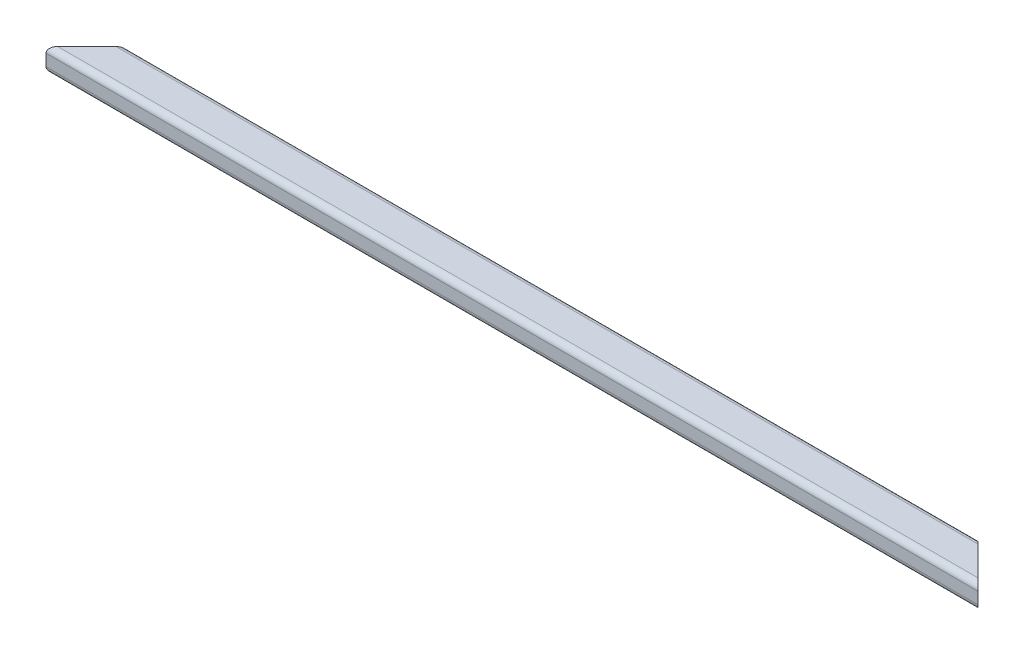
ISO-10303-21;
HEADER;
FILE_DESCRIPTION(('STEP AP214'),'2;1');
FILE_NAME('part.step','',(''),(''),'','','');
FILE_SCHEMA(('AUTOMOTIVE_DESIGN { 1 0 10303 214 1 1 1 1 }'));
ENDSEC;
DATA;
#1=APPLICATION_CONTEXT('core data for automotive mechanical design processes');
#2=APPLICATION_PROTOCOL_DEFINITION('international standard','automotive_design',2000,#1);
#3=PRODUCT_CONTEXT('',#1,'mechanical');
#4=PRODUCT('Part','Part','',(#3));
#5=PRODUCT_RELATED_PRODUCT_CATEGORY('part','',(#4));
#6=PRODUCT_DEFINITION_FORMATION('','',#4);
#7=PRODUCT_DEFINITION_CONTEXT('part definition',#1,'design');
#8=PRODUCT_DEFINITION('design','',#6,#7);
#9=PRODUCT_DEFINITION_SHAPE('','',#8);
#10=(LENGTH_UNIT() NAMED_UNIT(*) SI_UNIT(.MILLI.,.METRE.));
#11=(NAMED_UNIT(*) PLANE_ANGLE_UNIT() SI_UNIT($,.RADIAN.));
#12=(NAMED_UNIT(*) SI_UNIT($,.STERADIAN.) SOLID_ANGLE_UNIT());
#13=UNCERTAINTY_MEASURE_WITH_UNIT(LENGTH_MEASURE(1.E-05),#10,'distance_accuracy_value','');
#14=(GEOMETRIC_REPRESENTATION_CONTEXT(3) GLOBAL_UNCERTAINTY_ASSIGNED_CONTEXT((#13)) GLOBAL_UNIT_ASSIGNED_CONTEXT((#10,
#11,#12)) REPRESENTATION_CONTEXT('',''));
#15=CARTESIAN_POINT('',(0.,0.,0.));
#16=DIRECTION('',(0.,0.,1.));
#17=DIRECTION('',(1.,0.,0.));
#18=AXIS2_PLACEMENT_3D('',#15,#16,#17);
#19=CARTESIAN_POINT('',(800.,5.,-12.5));
#20=DIRECTION('',(-1.,0.,0.));
#21=DIRECTION('',(0.,0.,1.));
#22=AXIS2_PLACEMENT_3D('',#19,#20,#21);
#23=CYLINDRICAL_SURFACE('',#22,5.);
#24=DIRECTION('',(-1.,0.,0.));
#25=VECTOR('',#24,1.);
#26=CARTESIAN_POINT('',(800.,5.,-17.5));
#27=LINE('',#26,#25);
#28=CARTESIAN_POINT('',(765.,5.,-17.5));
#29=VERTEX_POINT('',#28);
#30=CARTESIAN_POINT('',(34.9999999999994,5.,-17.5));
#31=VERTEX_POINT('',#30);
#32=EDGE_CURVE('E222',#29,#31,#27,.T.);
#33=ORIENTED_EDGE('',*,*,#32,.T.);
#34=CARTESIAN_POINT('',(29.9999999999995,5.,-12.5));
#35=DIRECTION('',(0.707106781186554,0.,0.707106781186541));
#36=DIRECTION('',(-0.707106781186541,0.,0.707106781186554));
#37=AXIS2_PLACEMENT_3D('',#34,#35,#36);
#38=ELLIPSE('',#37,7.07106781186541,5.);
#39=CARTESIAN_POINT('',(29.9999999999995,10.,-12.5));
#40=VERTEX_POINT('',#39);
#41=EDGE_CURVE('E47',#31,#40,#38,.T.);
#42=ORIENTED_EDGE('',*,*,#41,.T.);
#43=DIRECTION('',(-1.,0.,0.));
#44=VECTOR('',#43,1.);
#45=CARTESIAN_POINT('',(800.,10.,-12.5));
#46=LINE('',#45,#44);
#47=CARTESIAN_POINT('',(770.,10.,-12.5));
#48=VERTEX_POINT('',#47);
#49=EDGE_CURVE('E161',#48,#40,#46,.T.);
#50=ORIENTED_EDGE('',*,*,#49,.F.);
#51=CARTESIAN_POINT('',(770.,5.,-12.5));
#52=DIRECTION('',(-0.707106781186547,0.,0.707106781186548));
#53=DIRECTION('',(-0.707106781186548,0.,-0.707106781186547));
#54=AXIS2_PLACEMENT_3D('',#51,#52,#53);
#55=ELLIPSE('',#54,7.07106781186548,5.);
#56=EDGE_CURVE('E201',#48,#29,#55,.T.);
#57=ORIENTED_EDGE('',*,*,#56,.T.);
#58=EDGE_LOOP('',(#33,#42,#50,#57));
#59=FACE_BOUND('',#58,.T.);
#60=ADVANCED_FACE('F33',(#59),#23,.T.);
#61=CARTESIAN_POINT('',(800.,10.,12.5));
#62=DIRECTION('',(0.,-1.,0.));
#63=DIRECTION('',(0.,0.,-1.));
#64=AXIS2_PLACEMENT_3D('',#61,#62,#63);
#65=PLANE('',#64);
#66=ORIENTED_EDGE('',*,*,#49,.T.);
#67=DIRECTION('',(0.707106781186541,0.,-0.707106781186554));
#68=VECTOR('',#67,1.);
#69=CARTESIAN_POINT('',(0.,10.,17.5));
#70=LINE('',#69,#68);
#71=CARTESIAN_POINT('',(4.9999999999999,10.,12.5));
#72=VERTEX_POINT('',#71);
#73=EDGE_CURVE('E145',#72,#40,#70,.T.);
#74=ORIENTED_EDGE('',*,*,#73,.F.);
#75=DIRECTION('',(-1.,0.,0.));
#76=VECTOR('',#75,1.);
#77=CARTESIAN_POINT('',(800.,10.,12.5));
#78=LINE('',#77,#76);
#79=CARTESIAN_POINT('',(795.,10.,12.5));
#80=VERTEX_POINT('',#79);
#81=EDGE_CURVE('E159',#80,#72,#78,.T.);
#82=ORIENTED_EDGE('',*,*,#81,.F.);
#83=DIRECTION('',(0.707106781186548,0.,0.707106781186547));
#84=VECTOR('',#83,1.);
#85=CARTESIAN_POINT('',(800.,10.,17.5));
#86=LINE('',#85,#84);
#87=EDGE_CURVE('E245',#48,#80,#86,.T.);
#88=ORIENTED_EDGE('',*,*,#87,.F.);
#89=EDGE_LOOP('',(#66,#74,#82,#88));
#90=FACE_BOUND('',#89,.T.);
#91=ADVANCED_FACE('F157',(#90),#65,.F.);
#92=CARTESIAN_POINT('',(800.,5.,12.5));
#93=DIRECTION('',(-1.,0.,0.));
#94=DIRECTION('',(0.,0.,1.));
#95=AXIS2_PLACEMENT_3D('',#92,#93,#94);
#96=CYLINDRICAL_SURFACE('',#95,5.);
#97=ORIENTED_EDGE('',*,*,#81,.T.);
#98=CARTESIAN_POINT('',(4.99999999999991,5.,12.5));
#99=DIRECTION('',(0.707106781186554,0.,0.707106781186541));
#100=DIRECTION('',(-0.707106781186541,0.,0.707106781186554));
#101=AXIS2_PLACEMENT_3D('',#98,#99,#100);
#102=ELLIPSE('',#101,7.07106781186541,5.);
#103=CARTESIAN_POINT('',(0.,5.,17.5));
#104=VERTEX_POINT('',#103);
#105=EDGE_CURVE('E142',#72,#104,#102,.T.);
#106=ORIENTED_EDGE('',*,*,#105,.T.);
#107=DIRECTION('',(-1.,0.,0.));
#108=VECTOR('',#107,1.);
#109=CARTESIAN_POINT('',(800.,5.,17.5));
#110=LINE('',#109,#108);
#111=CARTESIAN_POINT('',(800.,5.,17.5));
#112=VERTEX_POINT('',#111);
#113=EDGE_CURVE('E167',#112,#104,#110,.T.);
#114=ORIENTED_EDGE('',*,*,#113,.F.);
#115=CARTESIAN_POINT('',(795.,5.,12.5));
#116=DIRECTION('',(-0.707106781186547,0.,0.707106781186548));
#117=DIRECTION('',(-0.707106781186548,0.,-0.707106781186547));
#118=AXIS2_PLACEMENT_3D('',#115,#116,#117);
#119=ELLIPSE('',#118,7.07106781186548,5.);
#120=EDGE_CURVE('E166',#112,#80,#119,.T.);
#121=ORIENTED_EDGE('',*,*,#120,.T.);
#122=EDGE_LOOP('',(#97,#106,#114,#121));
#123=FACE_BOUND('',#122,.T.);
#124=ADVANCED_FACE('F165',(#123),#96,.T.);
#125=CARTESIAN_POINT('',(800.,5.,17.5));
#126=DIRECTION('',(0.,0.,-1.));
#127=DIRECTION('',(-1.,0.,0.));
#128=AXIS2_PLACEMENT_3D('',#125,#126,#127);
#129=PLANE('',#128);
#130=DIRECTION('',(0.,-1.,0.));
#131=VECTOR('',#130,1.);
#132=CARTESIAN_POINT('',(0.,5.,17.5));
#133=LINE('',#132,#131);
#134=CARTESIAN_POINT('',(0.,-5.,17.5));
#135=VERTEX_POINT('',#134);
#136=EDGE_CURVE('E147',#104,#135,#133,.T.);
#137=ORIENTED_EDGE('',*,*,#136,.T.);
#138=DIRECTION('',(-1.,0.,0.));
#139=VECTOR('',#138,1.);
#140=CARTESIAN_POINT('',(800.,-5.,17.5));
#141=LINE('',#140,#139);
#142=CARTESIAN_POINT('',(800.,-5.,17.5));
#143=VERTEX_POINT('',#142);
#144=EDGE_CURVE('E170',#143,#135,#141,.T.);
#145=ORIENTED_EDGE('',*,*,#144,.F.);
#146=DIRECTION('',(0.,-1.,0.));
#147=VECTOR('',#146,1.);
#148=CARTESIAN_POINT('',(800.,5.,17.5));
#149=LINE('',#148,#147);
#150=EDGE_CURVE('E220',#112,#143,#149,.T.);
#151=ORIENTED_EDGE('',*,*,#150,.F.);
#152=ORIENTED_EDGE('',*,*,#113,.T.);
#153=EDGE_LOOP('',(#137,#145,#151,#152));
#154=FACE_BOUND('',#153,.T.);
#155=ADVANCED_FACE('F243',(#154),#129,.F.);
#156=CARTESIAN_POINT('',(800.,-5.,12.5));
#157=DIRECTION('',(-1.,0.,0.));
#158=DIRECTION('',(0.,0.,1.));
#159=AXIS2_PLACEMENT_3D('',#156,#157,#158);
#160=CYLINDRICAL_SURFACE('',#159,5.);
#161=ORIENTED_EDGE('',*,*,#144,.T.);
#162=CARTESIAN_POINT('',(4.99999999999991,-5.,12.5));
#163=DIRECTION('',(0.707106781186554,0.,0.707106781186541));
#164=DIRECTION('',(-0.707106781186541,0.,0.707106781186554));
#165=AXIS2_PLACEMENT_3D('',#162,#163,#164);
#166=ELLIPSE('',#165,7.07106781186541,5.);
#167=CARTESIAN_POINT('',(4.99999999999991,-10.,12.5));
#168=VERTEX_POINT('',#167);
#169=EDGE_CURVE('E152',#135,#168,#166,.T.);
#170=ORIENTED_EDGE('',*,*,#169,.T.);
#171=DIRECTION('',(-1.,0.,0.));
#172=VECTOR('',#171,1.);
#173=CARTESIAN_POINT('',(800.,-10.,12.5));
#174=LINE('',#173,#172);
#175=CARTESIAN_POINT('',(795.,-10.,12.5));
#176=VERTEX_POINT('',#175);
#177=EDGE_CURVE('E231',#176,#168,#174,.T.);
#178=ORIENTED_EDGE('',*,*,#177,.F.);
#179=CARTESIAN_POINT('',(795.,-5.,12.5));
#180=DIRECTION('',(-0.707106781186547,0.,0.707106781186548));
#181=DIRECTION('',(-0.707106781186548,0.,-0.707106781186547));
#182=AXIS2_PLACEMENT_3D('',#179,#180,#181);
#183=ELLIPSE('',#182,7.07106781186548,5.);
#184=EDGE_CURVE('E240',#176,#143,#183,.T.);
#185=ORIENTED_EDGE('',*,*,#184,.T.);
#186=EDGE_LOOP('',(#161,#170,#178,#185));
#187=FACE_BOUND('',#186,.T.);
#188=ADVANCED_FACE('F238',(#187),#160,.T.);
#189=CARTESIAN_POINT('',(800.,-10.,12.5));
#190=DIRECTION('',(0.,1.,0.));
#191=DIRECTION('',(0.,0.,1.));
#192=AXIS2_PLACEMENT_3D('',#189,#190,#191);
#193=PLANE('',#192);
#194=ORIENTED_EDGE('',*,*,#177,.T.);
#195=DIRECTION('',(0.707106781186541,0.,-0.707106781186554));
#196=VECTOR('',#195,1.);
#197=CARTESIAN_POINT('',(0.,-10.,17.5));
#198=LINE('',#197,#196);
#199=CARTESIAN_POINT('',(29.9999999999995,-10.,-12.5));
#200=VERTEX_POINT('',#199);
#201=EDGE_CURVE('E162',#168,#200,#198,.T.);
#202=ORIENTED_EDGE('',*,*,#201,.T.);
#203=DIRECTION('',(-1.,0.,0.));
#204=VECTOR('',#203,1.);
#205=CARTESIAN_POINT('',(800.,-10.,-12.5));
#206=LINE('',#205,#204);
#207=CARTESIAN_POINT('',(770.,-10.,-12.5));
#208=VERTEX_POINT('',#207);
#209=EDGE_CURVE('E228',#208,#200,#206,.T.);
#210=ORIENTED_EDGE('',*,*,#209,.F.);
#211=DIRECTION('',(0.707106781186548,0.,0.707106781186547));
#212=VECTOR('',#211,1.);
#213=CARTESIAN_POINT('',(800.,-10.,17.5));
#214=LINE('',#213,#212);
#215=EDGE_CURVE('E264',#208,#176,#214,.T.);
#216=ORIENTED_EDGE('',*,*,#215,.T.);
#217=EDGE_LOOP('',(#194,#202,#210,#216));
#218=FACE_BOUND('',#217,.T.);
#219=ADVANCED_FACE('F290',(#218),#193,.F.);
#220=CARTESIAN_POINT('',(800.,-5.,-12.5));
#221=DIRECTION('',(-1.,0.,0.));
#222=DIRECTION('',(0.,0.,1.));
#223=AXIS2_PLACEMENT_3D('',#220,#221,#222);
#224=CYLINDRICAL_SURFACE('',#223,5.);
#225=ORIENTED_EDGE('',*,*,#209,.T.);
#226=CARTESIAN_POINT('',(29.9999999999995,-5.,-12.5));
#227=DIRECTION('',(0.707106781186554,0.,0.707106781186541));
#228=DIRECTION('',(-0.707106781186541,0.,0.707106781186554));
#229=AXIS2_PLACEMENT_3D('',#226,#227,#228);
#230=ELLIPSE('',#229,7.07106781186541,5.);
#231=CARTESIAN_POINT('',(34.9999999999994,-5.,-17.5));
#232=VERTEX_POINT('',#231);
#233=EDGE_CURVE('E269',#200,#232,#230,.T.);
#234=ORIENTED_EDGE('',*,*,#233,.T.);
#235=DIRECTION('',(-1.,0.,0.));
#236=VECTOR('',#235,1.);
#237=CARTESIAN_POINT('',(800.,-5.,-17.5));
#238=LINE('',#237,#236);
#239=CARTESIAN_POINT('',(765.,-5.,-17.5));
#240=VERTEX_POINT('',#239);
#241=EDGE_CURVE('E225',#240,#232,#238,.T.);
#242=ORIENTED_EDGE('',*,*,#241,.F.);
#243=CARTESIAN_POINT('',(770.,-5.,-12.5));
#244=DIRECTION('',(-0.707106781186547,0.,0.707106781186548));
#245=DIRECTION('',(-0.707106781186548,0.,-0.707106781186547));
#246=AXIS2_PLACEMENT_3D('',#243,#244,#245);
#247=ELLIPSE('',#246,7.07106781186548,5.);
#248=EDGE_CURVE('E248',#240,#208,#247,.T.);
#249=ORIENTED_EDGE('',*,*,#248,.T.);
#250=EDGE_LOOP('',(#225,#234,#242,#249));
#251=FACE_BOUND('',#250,.T.);
#252=ADVANCED_FACE('F292',(#251),#224,.T.);
#253=CARTESIAN_POINT('',(800.,5.,-17.5));
#254=DIRECTION('',(0.,0.,1.));
#255=DIRECTION('',(1.,0.,0.));
#256=AXIS2_PLACEMENT_3D('',#253,#254,#255);
#257=PLANE('',#256);
#258=ORIENTED_EDGE('',*,*,#241,.T.);
#259=DIRECTION('',(0.,1.,0.));
#260=VECTOR('',#259,1.);
#261=CARTESIAN_POINT('',(34.9999999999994,-10.,-17.5));
#262=LINE('',#261,#260);
#263=EDGE_CURVE('E285',#232,#31,#262,.T.);
#264=ORIENTED_EDGE('',*,*,#263,.T.);
#265=ORIENTED_EDGE('',*,*,#32,.F.);
#266=DIRECTION('',(0.,1.,0.));
#267=VECTOR('',#266,1.);
#268=CARTESIAN_POINT('',(765.,-10.,-17.5));
#269=LINE('',#268,#267);
#270=EDGE_CURVE('E194',#240,#29,#269,.T.);
#271=ORIENTED_EDGE('',*,*,#270,.F.);
#272=EDGE_LOOP('',(#258,#264,#265,#271));
#273=FACE_BOUND('',#272,.T.);
#274=ADVANCED_FACE('F297',(#273),#257,.F.);
#275=CARTESIAN_POINT('',(800.,5.,12.5));
#276=DIRECTION('',(-1.,0.,0.));
#277=DIRECTION('',(0.,0.,1.));
#278=AXIS2_PLACEMENT_3D('',#275,#276,#277);
#279=CYLINDRICAL_SURFACE('',#278,2.5);
#280=CARTESIAN_POINT('',(4.99999999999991,5.,12.5));
#281=DIRECTION('',(0.707106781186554,0.,0.707106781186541));
#282=DIRECTION('',(-0.707106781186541,0.,0.707106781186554));
#283=AXIS2_PLACEMENT_3D('',#280,#281,#282);
#284=ELLIPSE('',#283,3.53553390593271,2.5);
#285=CARTESIAN_POINT('',(4.99999999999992,7.5,12.5));
#286=VERTEX_POINT('',#285);
#287=CARTESIAN_POINT('',(2.49999999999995,5.,15.));
#288=VERTEX_POINT('',#287);
#289=EDGE_CURVE('E272',#286,#288,#284,.T.);
#290=ORIENTED_EDGE('',*,*,#289,.F.);
#291=DIRECTION('',(-1.,0.,0.));
#292=VECTOR('',#291,1.);
#293=CARTESIAN_POINT('',(800.,7.5,12.5));
#294=LINE('',#293,#292);
#295=CARTESIAN_POINT('',(795.,7.5,12.5));
#296=VERTEX_POINT('',#295);
#297=EDGE_CURVE('E197',#296,#286,#294,.T.);
#298=ORIENTED_EDGE('',*,*,#297,.F.);
#299=CARTESIAN_POINT('',(795.,5.,12.5));
#300=DIRECTION('',(-0.707106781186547,0.,0.707106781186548));
#301=DIRECTION('',(-0.707106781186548,0.,-0.707106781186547));
#302=AXIS2_PLACEMENT_3D('',#299,#300,#301);
#303=ELLIPSE('',#302,3.53553390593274,2.5);
#304=CARTESIAN_POINT('',(797.5,5.,15.));
#305=VERTEX_POINT('',#304);
#306=EDGE_CURVE('E181',#305,#296,#303,.T.);
#307=ORIENTED_EDGE('',*,*,#306,.F.);
#308=DIRECTION('',(-1.,0.,0.));
#309=VECTOR('',#308,1.);
#310=CARTESIAN_POINT('',(800.,5.,15.));
#311=LINE('',#310,#309);
#312=EDGE_CURVE('E216',#305,#288,#311,.T.);
#313=ORIENTED_EDGE('',*,*,#312,.T.);
#314=EDGE_LOOP('',(#290,#298,#307,#313));
#315=FACE_BOUND('',#314,.T.);
#316=ADVANCED_FACE('F318',(#315),#279,.F.);
#317=CARTESIAN_POINT('',(800.,5.,15.));
#318=DIRECTION('',(0.,0.,-1.));
#319=DIRECTION('',(-1.,0.,0.));
#320=AXIS2_PLACEMENT_3D('',#317,#318,#319);
#321=PLANE('',#320);
#322=DIRECTION('',(0.,-1.,0.));
#323=VECTOR('',#322,1.);
#324=CARTESIAN_POINT('',(2.49999999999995,5.,15.));
#325=LINE('',#324,#323);
#326=CARTESIAN_POINT('',(2.49999999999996,-5.,15.));
#327=VERTEX_POINT('',#326);
#328=EDGE_CURVE('E274',#288,#327,#325,.T.);
#329=ORIENTED_EDGE('',*,*,#328,.F.);
#330=ORIENTED_EDGE('',*,*,#312,.F.);
#331=DIRECTION('',(0.,1.,0.));
#332=VECTOR('',#331,1.);
#333=CARTESIAN_POINT('',(797.5,5.,15.));
#334=LINE('',#333,#332);
#335=CARTESIAN_POINT('',(797.5,-5.,15.));
#336=VERTEX_POINT('',#335);
#337=EDGE_CURVE('E254',#336,#305,#334,.T.);
#338=ORIENTED_EDGE('',*,*,#337,.F.);
#339=DIRECTION('',(-1.,0.,0.));
#340=VECTOR('',#339,1.);
#341=CARTESIAN_POINT('',(800.,-5.,15.));
#342=LINE('',#341,#340);
#343=EDGE_CURVE('E213',#336,#327,#342,.T.);
#344=ORIENTED_EDGE('',*,*,#343,.T.);
#345=EDGE_LOOP('',(#329,#330,#338,#344));
#346=FACE_BOUND('',#345,.T.);
#347=ADVANCED_FACE('F321',(#346),#321,.T.);
#348=CARTESIAN_POINT('',(800.,-5.,12.5));
#349=DIRECTION('',(-1.,0.,0.));
#350=DIRECTION('',(0.,0.,1.));
#351=AXIS2_PLACEMENT_3D('',#348,#349,#350);
#352=CYLINDRICAL_SURFACE('',#351,2.5);
#353=CARTESIAN_POINT('',(4.99999999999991,-5.,12.5));
#354=DIRECTION('',(0.707106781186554,0.,0.707106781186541));
#355=DIRECTION('',(-0.707106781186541,0.,0.707106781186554));
#356=AXIS2_PLACEMENT_3D('',#353,#354,#355);
#357=ELLIPSE('',#356,3.53553390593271,2.5);
#358=CARTESIAN_POINT('',(4.99999999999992,-7.5,12.5));
#359=VERTEX_POINT('',#358);
#360=EDGE_CURVE('E276',#327,#359,#357,.T.);
#361=ORIENTED_EDGE('',*,*,#360,.F.);
#362=ORIENTED_EDGE('',*,*,#343,.F.);
#363=CARTESIAN_POINT('',(795.,-5.,12.5));
#364=DIRECTION('',(-0.707106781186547,0.,0.707106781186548));
#365=DIRECTION('',(-0.707106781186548,0.,-0.707106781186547));
#366=AXIS2_PLACEMENT_3D('',#363,#364,#365);
#367=ELLIPSE('',#366,3.53553390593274,2.5);
#368=CARTESIAN_POINT('',(795.,-7.5,12.5));
#369=VERTEX_POINT('',#368);
#370=EDGE_CURVE('E256',#369,#336,#367,.T.);
#371=ORIENTED_EDGE('',*,*,#370,.F.);
#372=DIRECTION('',(-1.,0.,0.));
#373=VECTOR('',#372,1.);
#374=CARTESIAN_POINT('',(800.,-7.5,12.5));
#375=LINE('',#374,#373);
#376=EDGE_CURVE('E210',#369,#359,#375,.T.);
#377=ORIENTED_EDGE('',*,*,#376,.T.);
#378=EDGE_LOOP('',(#361,#362,#371,#377));
#379=FACE_BOUND('',#378,.T.);
#380=ADVANCED_FACE('F325',(#379),#352,.F.);
#381=CARTESIAN_POINT('',(800.,-7.5,12.5));
#382=DIRECTION('',(0.,1.,0.));
#383=DIRECTION('',(0.,0.,1.));
#384=AXIS2_PLACEMENT_3D('',#381,#382,#383);
#385=PLANE('',#384);
#386=DIRECTION('',(0.707106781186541,0.,-0.707106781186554));
#387=VECTOR('',#386,1.);
#388=CARTESIAN_POINT('',(402.499999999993,-7.5,-385.));
#389=LINE('',#388,#387);
#390=CARTESIAN_POINT('',(29.9999999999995,-7.5,-12.5));
#391=VERTEX_POINT('',#390);
#392=EDGE_CURVE('E278',#359,#391,#389,.T.);
#393=ORIENTED_EDGE('',*,*,#392,.F.);
#394=ORIENTED_EDGE('',*,*,#376,.F.);
#395=DIRECTION('',(0.707106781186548,0.,0.707106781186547));
#396=VECTOR('',#395,1.);
#397=CARTESIAN_POINT('',(797.5,-7.5,15.));
#398=LINE('',#397,#396);
#399=CARTESIAN_POINT('',(770.,-7.5,-12.5));
#400=VERTEX_POINT('',#399);
#401=EDGE_CURVE('E258',#400,#369,#398,.T.);
#402=ORIENTED_EDGE('',*,*,#401,.F.);
#403=DIRECTION('',(-1.,0.,0.));
#404=VECTOR('',#403,1.);
#405=CARTESIAN_POINT('',(800.,-7.5,-12.5));
#406=LINE('',#405,#404);
#407=EDGE_CURVE('E207',#400,#391,#406,.T.);
#408=ORIENTED_EDGE('',*,*,#407,.T.);
#409=EDGE_LOOP('',(#393,#394,#402,#408));
#410=FACE_BOUND('',#409,.T.);
#411=ADVANCED_FACE('F329',(#410),#385,.T.);
#412=CARTESIAN_POINT('',(800.,-5.,-12.5));
#413=DIRECTION('',(-1.,0.,0.));
#414=DIRECTION('',(0.,0.,1.));
#415=AXIS2_PLACEMENT_3D('',#412,#413,#414);
#416=CYLINDRICAL_SURFACE('',#415,2.5);
#417=CARTESIAN_POINT('',(29.9999999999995,-5.,-12.5));
#418=DIRECTION('',(0.707106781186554,0.,0.707106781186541));
#419=DIRECTION('',(-0.707106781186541,0.,0.707106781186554));
#420=AXIS2_PLACEMENT_3D('',#417,#418,#419);
#421=ELLIPSE('',#420,3.53553390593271,2.5);
#422=CARTESIAN_POINT('',(32.4999999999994,-5.,-15.));
#423=VERTEX_POINT('',#422);
#424=EDGE_CURVE('E280',#391,#423,#421,.T.);
#425=ORIENTED_EDGE('',*,*,#424,.F.);
#426=ORIENTED_EDGE('',*,*,#407,.F.);
#427=CARTESIAN_POINT('',(770.,-5.,-12.5));
#428=DIRECTION('',(-0.707106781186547,0.,0.707106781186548));
#429=DIRECTION('',(-0.707106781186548,0.,-0.707106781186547));
#430=AXIS2_PLACEMENT_3D('',#427,#428,#429);
#431=ELLIPSE('',#430,3.53553390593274,2.5);
#432=CARTESIAN_POINT('',(767.5,-5.,-15.));
#433=VERTEX_POINT('',#432);
#434=EDGE_CURVE('E260',#433,#400,#431,.T.);
#435=ORIENTED_EDGE('',*,*,#434,.F.);
#436=DIRECTION('',(-1.,0.,0.));
#437=VECTOR('',#436,1.);
#438=CARTESIAN_POINT('',(800.,-5.,-15.));
#439=LINE('',#438,#437);
#440=EDGE_CURVE('E199',#433,#423,#439,.T.);
#441=ORIENTED_EDGE('',*,*,#440,.T.);
#442=EDGE_LOOP('',(#425,#426,#435,#441));
#443=FACE_BOUND('',#442,.T.);
#444=ADVANCED_FACE('F333',(#443),#416,.F.);
#445=CARTESIAN_POINT('',(800.,5.,-15.));
#446=DIRECTION('',(0.,0.,1.));
#447=DIRECTION('',(1.,0.,0.));
#448=AXIS2_PLACEMENT_3D('',#445,#446,#447);
#449=PLANE('',#448);
#450=DIRECTION('',(0.,1.,0.));
#451=VECTOR('',#450,1.);
#452=CARTESIAN_POINT('',(32.4999999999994,5.,-15.));
#453=LINE('',#452,#451);
#454=CARTESIAN_POINT('',(32.4999999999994,5.,-15.));
#455=VERTEX_POINT('',#454);
#456=EDGE_CURVE('E282',#423,#455,#453,.T.);
#457=ORIENTED_EDGE('',*,*,#456,.F.);
#458=ORIENTED_EDGE('',*,*,#440,.F.);
#459=DIRECTION('',(0.,-1.,0.));
#460=VECTOR('',#459,1.);
#461=CARTESIAN_POINT('',(767.5,5.,-15.));
#462=LINE('',#461,#460);
#463=CARTESIAN_POINT('',(767.5,5.,-15.));
#464=VERTEX_POINT('',#463);
#465=EDGE_CURVE('E193',#464,#433,#462,.T.);
#466=ORIENTED_EDGE('',*,*,#465,.F.);
#467=DIRECTION('',(-1.,0.,0.));
#468=VECTOR('',#467,1.);
#469=CARTESIAN_POINT('',(800.,5.,-15.));
#470=LINE('',#469,#468);
#471=EDGE_CURVE('E192',#464,#455,#470,.T.);
#472=ORIENTED_EDGE('',*,*,#471,.T.);
#473=EDGE_LOOP('',(#457,#458,#466,#472));
#474=FACE_BOUND('',#473,.T.);
#475=ADVANCED_FACE('F337',(#474),#449,.T.);
#476=CARTESIAN_POINT('',(800.,5.,-12.5));
#477=DIRECTION('',(-1.,0.,0.));
#478=DIRECTION('',(0.,0.,1.));
#479=AXIS2_PLACEMENT_3D('',#476,#477,#478);
#480=CYLINDRICAL_SURFACE('',#479,2.5);
#481=CARTESIAN_POINT('',(29.9999999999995,5.,-12.5));
#482=DIRECTION('',(0.707106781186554,0.,0.707106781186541));
#483=DIRECTION('',(-0.707106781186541,0.,0.707106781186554));
#484=AXIS2_PLACEMENT_3D('',#481,#482,#483);
#485=ELLIPSE('',#484,3.53553390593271,2.5);
#486=CARTESIAN_POINT('',(29.9999999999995,7.5,-12.5));
#487=VERTEX_POINT('',#486);
#488=EDGE_CURVE('E54',#455,#487,#485,.T.);
#489=ORIENTED_EDGE('',*,*,#488,.F.);
#490=ORIENTED_EDGE('',*,*,#471,.F.);
#491=CARTESIAN_POINT('',(770.,5.,-12.5));
#492=DIRECTION('',(-0.707106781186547,0.,0.707106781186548));
#493=DIRECTION('',(-0.707106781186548,0.,-0.707106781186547));
#494=AXIS2_PLACEMENT_3D('',#491,#492,#493);
#495=ELLIPSE('',#494,3.53553390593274,2.5);
#496=CARTESIAN_POINT('',(770.,7.5,-12.5));
#497=VERTEX_POINT('',#496);
#498=EDGE_CURVE('E178',#497,#464,#495,.T.);
#499=ORIENTED_EDGE('',*,*,#498,.F.);
#500=DIRECTION('',(-1.,0.,0.));
#501=VECTOR('',#500,1.);
#502=CARTESIAN_POINT('',(800.,7.5,-12.5));
#503=LINE('',#502,#501);
#504=EDGE_CURVE('E190',#497,#487,#503,.T.);
#505=ORIENTED_EDGE('',*,*,#504,.T.);
#506=EDGE_LOOP('',(#489,#490,#499,#505));
#507=FACE_BOUND('',#506,.T.);
#508=ADVANCED_FACE('F189',(#507),#480,.F.);
#509=CARTESIAN_POINT('',(800.,7.5,12.5));
#510=DIRECTION('',(0.,-1.,0.));
#511=DIRECTION('',(0.,0.,-1.));
#512=AXIS2_PLACEMENT_3D('',#509,#510,#511);
#513=PLANE('',#512);
#514=DIRECTION('',(-0.707106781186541,0.,0.707106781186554));
#515=VECTOR('',#514,1.);
#516=CARTESIAN_POINT('',(402.499999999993,7.5,-385.));
#517=LINE('',#516,#515);
#518=EDGE_CURVE('E11',#487,#286,#517,.T.);
#519=ORIENTED_EDGE('',*,*,#518,.F.);
#520=ORIENTED_EDGE('',*,*,#504,.F.);
#521=DIRECTION('',(-0.707106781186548,0.,-0.707106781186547));
#522=VECTOR('',#521,1.);
#523=CARTESIAN_POINT('',(797.5,7.5,15.));
#524=LINE('',#523,#522);
#525=EDGE_CURVE('E40',#296,#497,#524,.T.);
#526=ORIENTED_EDGE('',*,*,#525,.F.);
#527=ORIENTED_EDGE('',*,*,#297,.T.);
#528=EDGE_LOOP('',(#519,#520,#526,#527));
#529=FACE_BOUND('',#528,.T.);
#530=ADVANCED_FACE('F196',(#529),#513,.T.);
#531=CARTESIAN_POINT('',(800.,-10.,17.5));
#532=DIRECTION('',(-0.707106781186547,0.,0.707106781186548));
#533=DIRECTION('',(0.707106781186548,0.,0.707106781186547));
#534=AXIS2_PLACEMENT_3D('',#531,#532,#533);
#535=PLANE('',#534);
#536=ORIENTED_EDGE('',*,*,#306,.T.);
#537=ORIENTED_EDGE('',*,*,#525,.T.);
#538=ORIENTED_EDGE('',*,*,#498,.T.);
#539=ORIENTED_EDGE('',*,*,#465,.T.);
#540=ORIENTED_EDGE('',*,*,#434,.T.);
#541=ORIENTED_EDGE('',*,*,#401,.T.);
#542=ORIENTED_EDGE('',*,*,#370,.T.);
#543=ORIENTED_EDGE('',*,*,#337,.T.);
#544=EDGE_LOOP('',(#536,#537,#538,#539,#540,#541,#542,#543));
#545=FACE_BOUND('',#544,.T.);
#546=ORIENTED_EDGE('',*,*,#87,.T.);
#547=ORIENTED_EDGE('',*,*,#120,.F.);
#548=ORIENTED_EDGE('',*,*,#150,.T.);
#549=ORIENTED_EDGE('',*,*,#184,.F.);
#550=ORIENTED_EDGE('',*,*,#215,.F.);
#551=ORIENTED_EDGE('',*,*,#248,.F.);
#552=ORIENTED_EDGE('',*,*,#270,.T.);
#553=ORIENTED_EDGE('',*,*,#56,.F.);
#554=EDGE_LOOP('',(#546,#547,#548,#549,#550,#551,#552,#553));
#555=FACE_BOUND('',#554,.T.);
#556=ADVANCED_FACE('F176',(#545,#555),#535,.F.);
#557=CARTESIAN_POINT('',(0.,-10.,17.5));
#558=DIRECTION('',(0.707106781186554,0.,0.707106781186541));
#559=DIRECTION('',(0.707106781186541,0.,-0.707106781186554));
#560=AXIS2_PLACEMENT_3D('',#557,#558,#559);
#561=PLANE('',#560);
#562=ORIENTED_EDGE('',*,*,#289,.T.);
#563=ORIENTED_EDGE('',*,*,#328,.T.);
#564=ORIENTED_EDGE('',*,*,#360,.T.);
#565=ORIENTED_EDGE('',*,*,#392,.T.);
#566=ORIENTED_EDGE('',*,*,#424,.T.);
#567=ORIENTED_EDGE('',*,*,#456,.T.);
#568=ORIENTED_EDGE('',*,*,#488,.T.);
#569=ORIENTED_EDGE('',*,*,#518,.T.);
#570=EDGE_LOOP('',(#562,#563,#564,#565,#566,#567,#568,#569));
#571=FACE_BOUND('',#570,.T.);
#572=ORIENTED_EDGE('',*,*,#263,.F.);
#573=ORIENTED_EDGE('',*,*,#233,.F.);
#574=ORIENTED_EDGE('',*,*,#201,.F.);
#575=ORIENTED_EDGE('',*,*,#169,.F.);
#576=ORIENTED_EDGE('',*,*,#136,.F.);
#577=ORIENTED_EDGE('',*,*,#105,.F.);
#578=ORIENTED_EDGE('',*,*,#73,.T.);
#579=ORIENTED_EDGE('',*,*,#41,.F.);
#580=EDGE_LOOP('',(#572,#573,#574,#575,#576,#577,#578,#579));
#581=FACE_BOUND('',#580,.T.);
#582=ADVANCED_FACE('F144',(#571,#581),#561,.F.);
#583=CLOSED_SHELL('',(#60,#91,#124,#155,#188,#219,#252,#274,#316,#347,#380,#411,#444,#475,#508,
#530,#556,#582));
#584=MANIFOLD_SOLID_BREP('B2',#583);
#585=ADVANCED_BREP_SHAPE_REPRESENTATION('',(#18,#584),#14);
#586=SHAPE_DEFINITION_REPRESENTATION(#9,#585);
ENDSEC;
END-ISO-10303-21;
